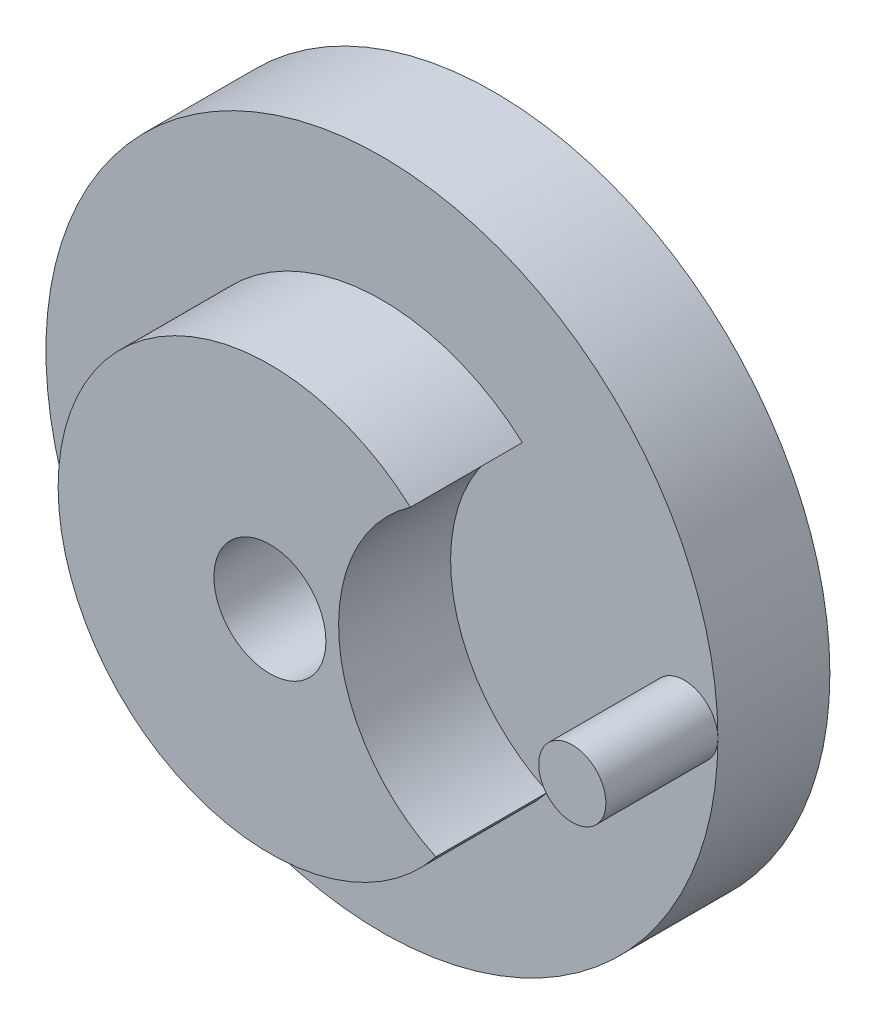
from build123d import *

# Parameters (mm, degrees)
ESQUISSE1_R             = 30
ESQUISSE1_R_2           = 5
EXTRUSION1_DEPTH        = 10
ESQUISSE4_R             = 3
EXTRUSION2_DEPTH        = 10
ESQUISSE5_R             = 18.91
EXTRUSION3_DEPTH        = 10
ENL_V_START             = -10
ESQUISSE6_R             = 5
ENL_V_MAT_EXTRU_1_DEPTH = 10
ENL_V_MAT_EXTRU_2_DEPTH = 10


with BuildPart() as part:
    # Esquisse1 → Extrusion1 (new body)
    with BuildSketch(Plane.XY):
        Circle(ESQUISSE1_R)
        Circle(ESQUISSE1_R_2, mode=Mode.SUBTRACT)
    extrude(amount=EXTRUSION1_DEPTH)

    # Esquisse4 → Extrusion2 (add)
    with BuildSketch(Plane.XY.offset(10)):
        with Locations((27, 0)):
            Circle(ESQUISSE4_R)
    extrude(amount=EXTRUSION2_DEPTH)

    # Esquisse5 → Extrusion3 (add)
    with BuildSketch(Plane.XY.offset(10)):
        Circle(ESQUISSE5_R)
    extrude(amount=EXTRUSION3_DEPTH)

    # Esquisse6 → Enl_v. mat.-Extru.1 (cut)
    with BuildSketch(Plane.XY.offset(20).offset(ENL_V_START)):
        Circle(ESQUISSE6_R)
    extrude(amount=ENL_V_MAT_EXTRU_1_DEPTH, mode=Mode.SUBTRACT)

    # Esquisse7 → Enl_v. mat.-Extru.2 (cut)
    with BuildSketch(Plane.XY.offset(20).offset(ENL_V_START)):
        with BuildLine():
            ThreePointArc((12.546362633, 14.14838806), (6.189560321, 0.54151636), (14.812596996, -11.754789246))
            ThreePointArc((14.812596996, -11.754789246), (18.838041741, 1.648115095), (12.546362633, 14.14838806))
        make_face()
    extrude(amount=ENL_V_MAT_EXTRU_2_DEPTH, mode=Mode.SUBTRACT)


solid = part.part
